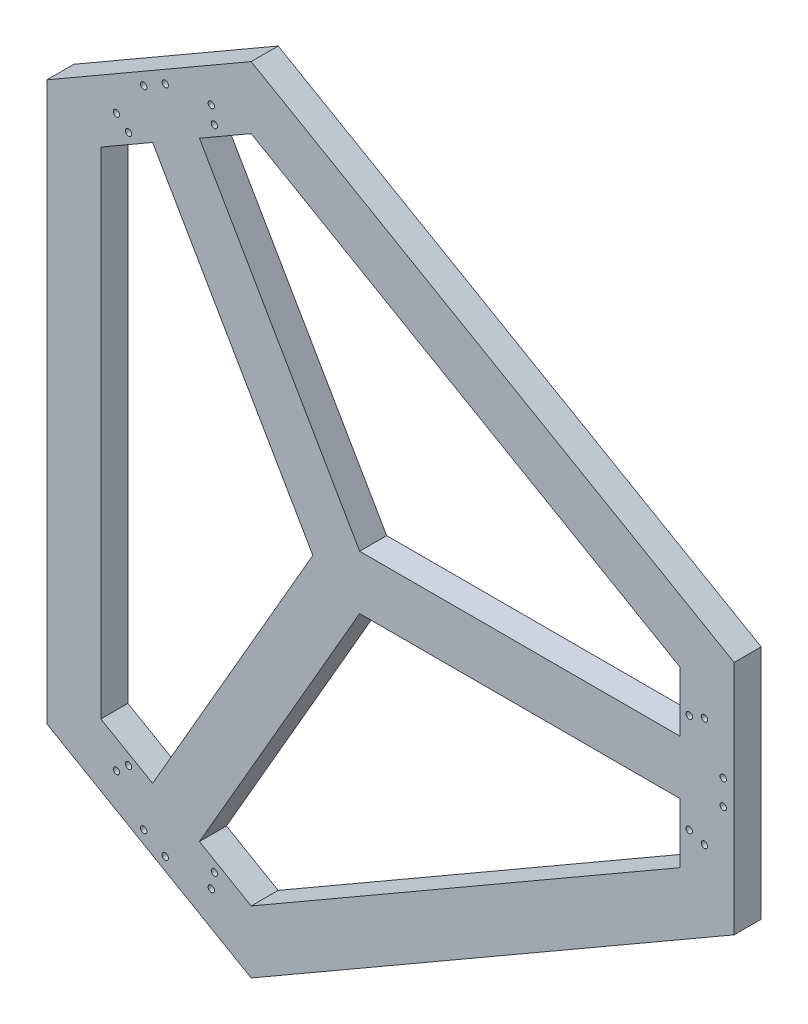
from build123d import *

# Parameters (mm, degrees)
SKETCH2_R           = 3
BOSS_EXTRUDE1_DEPTH = 25.4
BOSS_EXTRUDE2_DEPTH = 25.4


with BuildPart() as part:
    # Sketch2 → Boss-Extrude1 (new body)
    with BuildSketch(Plane.XY):
        Polygon((-279.470702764, 262.191672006), (-279.470702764, -262.191672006), (-87.329297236, -373.12456421), (366.8, -110.932892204), (366.8, 110.932892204), (-87.329297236, 373.12456421), align=None)
        with Locations((-121.906704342, -304.371002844)):
            Circle(SKETCH2_R, mode=Mode.SUBTRACT)
        with Locations((-124.845889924, -319.202828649)):
            Circle(SKETCH2_R, mode=Mode.SUBTRACT)
        with Locations((-168.161355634, -314.604883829)):
            Circle(SKETCH2_R, mode=Mode.SUBTRACT)
        with Locations((-188.375143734, -302.934447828)):
            Circle(SKETCH2_R, mode=Mode.SUBTRACT)
        with Locations((-214.014813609, -267.721126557)):
            Circle(SKETCH2_R, mode=Mode.SUBTRACT)
        with Locations((-202.639668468, -257.759804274)):
            Circle(SKETCH2_R, mode=Mode.SUBTRACT)
        with Locations((324.546372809, 46.61119857)):
            Circle(SKETCH2_R, mode=Mode.SUBTRACT)
        with Locations((338.860703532, 51.481702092)):
            Circle(SKETCH2_R, mode=Mode.SUBTRACT)
        with Locations((356.536499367, 11.670436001)):
            Circle(SKETCH2_R, mode=Mode.SUBTRACT)
        with Locations((356.536499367, -11.670436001)):
            Circle(SKETCH2_R, mode=Mode.SUBTRACT)
        with Locations((324.546372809, -46.611198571)):
            Circle(SKETCH2_R, mode=Mode.SUBTRACT)
        with Locations((338.860703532, -51.481702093)):
            Circle(SKETCH2_R, mode=Mode.SUBTRACT)
        with Locations((-202.639668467, 257.759804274)):
            Circle(SKETCH2_R, mode=Mode.SUBTRACT)
        with Locations((-214.014813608, 267.721126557)):
            Circle(SKETCH2_R, mode=Mode.SUBTRACT)
        with Locations((-188.375143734, 302.934447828)):
            Circle(SKETCH2_R, mode=Mode.SUBTRACT)
        with Locations((-168.161355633, 314.604883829)):
            Circle(SKETCH2_R, mode=Mode.SUBTRACT)
        with Locations((-124.845889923, 319.20282865)):
            Circle(SKETCH2_R, mode=Mode.SUBTRACT)
        with Locations((-121.906704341, 304.371002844)):
            Circle(SKETCH2_R, mode=Mode.SUBTRACT)
        Polygon((-228.670702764, 232.862278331), (-87.329297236, 314.465776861), (316, 81.603498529), (316, -81.603498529), (-87.329297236, -314.465776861), (-228.670702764, -232.862278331), align=None, mode=Mode.SUBTRACT)
    extrude(amount=BOSS_EXTRUDE1_DEPTH)

    # Sketch4 → Boss-Extrude2 (add)
    with BuildSketch(Plane.XY.offset(25.4)):
        Polygon((316, -25.4), (14.664696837, -25.4), (-136.002954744, -286.364027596), (-179.997045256, -260.964027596), (-29.329393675, 0), (-179.997045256, 260.964027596), (-136.002954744, 286.364027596), (14.664696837, 25.4), (316, 25.4), align=None)
    extrude(amount=-BOSS_EXTRUDE2_DEPTH)


solid = part.part
